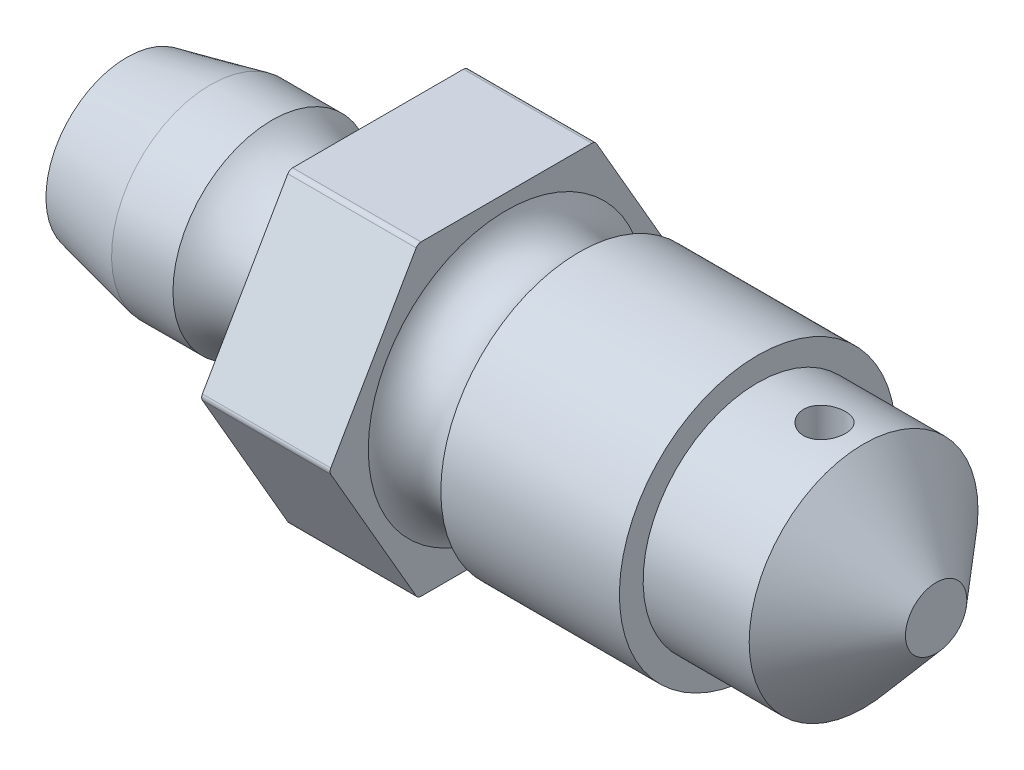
from build123d import *

# Parameters (mm, degrees)
HOLE_WIZARD_3_0_3_1_D     = 3
HOLE_WIZARD_3_0_3_1_DEPTH = 26.5
HOLE_WIZARD_3_0_3_1_TIP   = 0.901290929
HOLE_WIZARD_1_5_1_5_1_D   = 1.5
SKETCH_8_OUTSIDE_W        = 21.868
SKETCH_8_OUTSIDE_H        = 21.868
CUT_EXTRUDE_1_DEPTH       = 23.011360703
FILLET_1_R                = 0.2


with BuildPart() as part:
    # Sketch 1 → Revolve 1 (revolve)
    with BuildSketch(Plane.XY):
        Polygon((0, 0), (0, 2.9), (3, 3.55), (9, 3.55), (9, 6.5), (13.6, 6.5), (13.6, 4.95), (22.6, 4.95), (22.6, 4.1), (26.4, 4.1), (29, 1.1), (29, 0), align=None)
    revolve(axis=Axis((29, 0, 0), (-1, 0, 0)))

    # Sketch 2 → Cut-Revolve 1 (revolve, cut)
    with BuildSketch(Plane(origin=(0, 0, 0), x_dir=(1, 0, 0), z_dir=(0, 1, 0)), mode=Mode.PRIVATE) as cut_revolve_1_sk:
        with BuildLine():
            Line((5.2, 3.55), (5.2, 6.5))
            Line((5.2, 6.5), (9, 6.5))
            Line((9, 6.5), (9, 3.55))
            ThreePointArc((9, 3.55), (7.1, 2.8), (5.2, 3.55))
        make_face()
        with BuildLine():
            Line((13.6, 4.95), (13.6, 6.5))
            Line((13.6, 6.5), (16.2, 6.5))
            Line((16.2, 6.5), (16.2, 4.95))
            ThreePointArc((16.2, 4.95), (14.9, 4.05), (13.6, 4.95))
        make_face()
    revolve(cut_revolve_1_sk.sketch.rotate(Axis((0, 0, 0), (1, 0, 0)), 180), axis=Axis((0, 0, 0), (1, 0, 0)), mode=Mode.SUBTRACT)

    # Hole Wizard 3.0 _3_ _1
    with Locations(Plane.ZY):
        with Locations((0, 0)):
            Hole(HOLE_WIZARD_3_0_3_1_D / 2, depth=HOLE_WIZARD_3_0_3_1_DEPTH)
            with Locations((0, 0, -(HOLE_WIZARD_3_0_3_1_DEPTH + HOLE_WIZARD_3_0_3_1_TIP / 2))):  # 118° drill point
                Cone(0, HOLE_WIZARD_3_0_3_1_D / 2, HOLE_WIZARD_3_0_3_1_TIP, mode=Mode.SUBTRACT)

    # Hole Wizard 1.5 _1.5_ _1 (through all)
    with Locations(Plane(origin=(25, 4.1, 0), x_dir=(0, 0, 1), z_dir=(0, 1, 0))):
        with Locations((0, 0)):
            Hole(HOLE_WIZARD_1_5_1_5_1_D / 2)

    # Sketch 8 outside → Cut-Extrude 1 (cut, through all)
    with BuildSketch(Plane.ZY.offset(-9)):
        Rectangle(SKETCH_8_OUTSIDE_W, SKETCH_8_OUTSIDE_H)
        Polygon((6.350852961, 0), (3.175426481, 5.5), (-3.175426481, 5.5), (-6.350852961, 0), (-3.175426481, -5.5), (3.175426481, -5.5), align=None, mode=Mode.SUBTRACT)
    extrude(amount=-CUT_EXTRUDE_1_DEPTH, mode=Mode.SUBTRACT)

    # Fillet 1
    fillet_1_edges = [part.edges().sort_by_distance(p)[0] for p in [
        (11.3, -5.5, 3.175426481),
        (11.3, -5.5, -3.175426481),
        (11.3, 0, -6.350852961),
        (11.3, 5.5, -3.175426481),
        (11.3, 5.5, 3.175426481),
        (11.3, 0, 6.350852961),
    ]]
    fillet(fillet_1_edges, radius=FILLET_1_R)


solid = part.part
